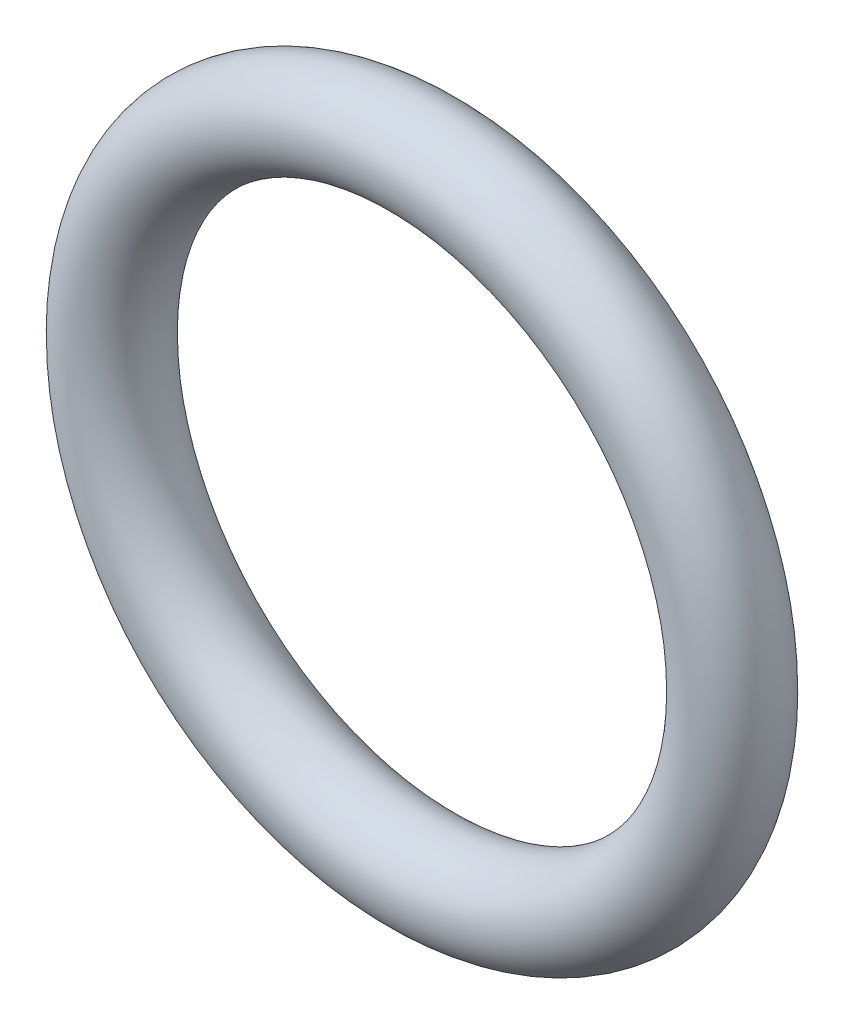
from build123d import *

# Parameters (mm, degrees)
SKETCH3_R = 0.8


with BuildPart() as part:
    # Sketch3 → Revolve1 (revolve)
    with BuildSketch(Plane(origin=(0, 0, 0), x_dir=(1, 0, 0), z_dir=(0, 1, 0))):
        with Locations((5.35, 0)):
            Circle(SKETCH3_R)
    revolve(axis=Axis((0, 0, 0.8), (0, 0, -1)))


solid = part.part
